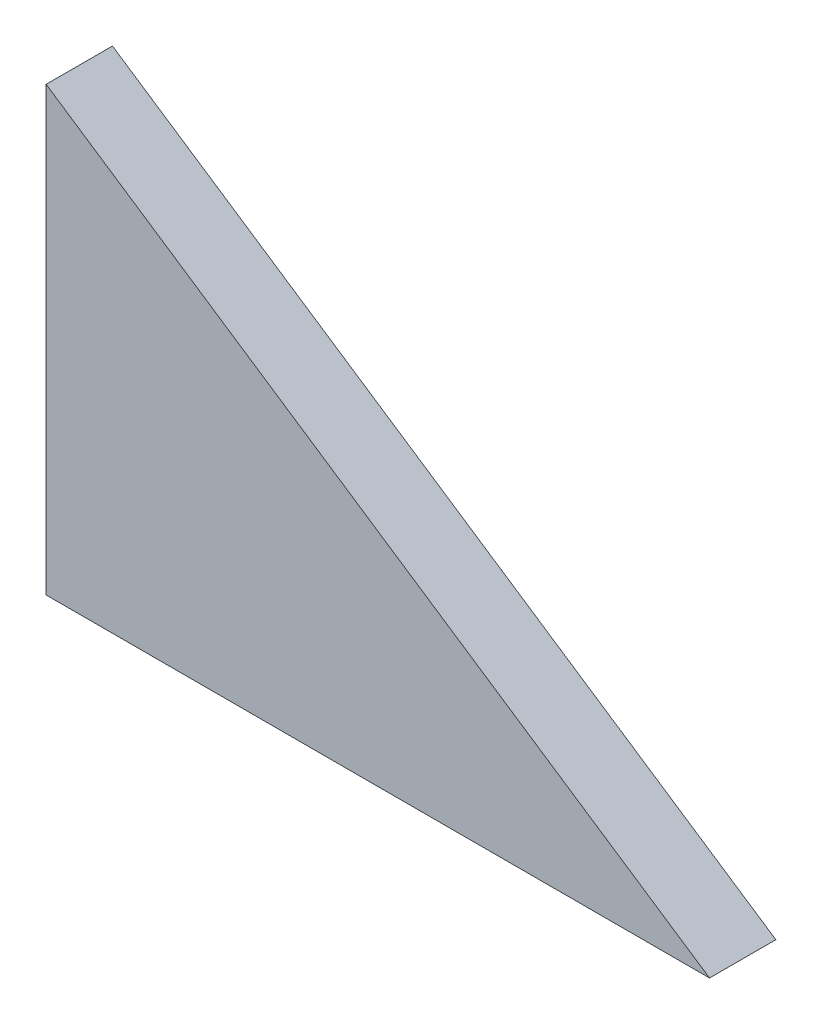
ISO-10303-21;
HEADER;
FILE_DESCRIPTION(('STEP AP214'),'2;1');
FILE_NAME('part.step','',(''),(''),'','','');
FILE_SCHEMA(('AUTOMOTIVE_DESIGN { 1 0 10303 214 1 1 1 1 }'));
ENDSEC;
DATA;
#1=APPLICATION_CONTEXT('core data for automotive mechanical design processes');
#2=APPLICATION_PROTOCOL_DEFINITION('international standard','automotive_design',2000,#1);
#3=PRODUCT_CONTEXT('',#1,'mechanical');
#4=PRODUCT('Part','Part','',(#3));
#5=PRODUCT_RELATED_PRODUCT_CATEGORY('part','',(#4));
#6=PRODUCT_DEFINITION_FORMATION('','',#4);
#7=PRODUCT_DEFINITION_CONTEXT('part definition',#1,'design');
#8=PRODUCT_DEFINITION('design','',#6,#7);
#9=PRODUCT_DEFINITION_SHAPE('','',#8);
#10=(LENGTH_UNIT() NAMED_UNIT(*) SI_UNIT(.MILLI.,.METRE.));
#11=(NAMED_UNIT(*) PLANE_ANGLE_UNIT() SI_UNIT($,.RADIAN.));
#12=(NAMED_UNIT(*) SI_UNIT($,.STERADIAN.) SOLID_ANGLE_UNIT());
#13=UNCERTAINTY_MEASURE_WITH_UNIT(LENGTH_MEASURE(1.E-05),#10,'distance_accuracy_value','');
#14=(GEOMETRIC_REPRESENTATION_CONTEXT(3) GLOBAL_UNCERTAINTY_ASSIGNED_CONTEXT((#13)) GLOBAL_UNIT_ASSIGNED_CONTEXT((#10,
#11,#12)) REPRESENTATION_CONTEXT('',''));
#15=CARTESIAN_POINT('',(0.,0.,0.));
#16=DIRECTION('',(0.,0.,1.));
#17=DIRECTION('',(1.,0.,0.));
#18=AXIS2_PLACEMENT_3D('',#15,#16,#17);
#19=CARTESIAN_POINT('',(0.,20.,3.));
#20=DIRECTION('',(-0.554700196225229,-0.832050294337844,0.));
#21=DIRECTION('',(0.832050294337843,-0.554700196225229,0.));
#22=AXIS2_PLACEMENT_3D('',#19,#20,#21);
#23=PLANE('',#22);
#24=DIRECTION('',(-0.832050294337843,0.554700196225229,0.));
#25=VECTOR('',#24,1.);
#26=CARTESIAN_POINT('',(0.,20.,0.));
#27=LINE('',#26,#25);
#28=CARTESIAN_POINT('',(30.,0.,0.));
#29=VERTEX_POINT('',#28);
#30=CARTESIAN_POINT('',(0.,20.,0.));
#31=VERTEX_POINT('',#30);
#32=EDGE_CURVE('E66',#29,#31,#27,.T.);
#33=ORIENTED_EDGE('',*,*,#32,.T.);
#34=DIRECTION('',(0.,0.,-1.));
#35=VECTOR('',#34,1.);
#36=CARTESIAN_POINT('',(0.,20.,3.));
#37=LINE('',#36,#35);
#38=CARTESIAN_POINT('',(0.,20.,3.));
#39=VERTEX_POINT('',#38);
#40=EDGE_CURVE('E11',#39,#31,#37,.T.);
#41=ORIENTED_EDGE('',*,*,#40,.F.);
#42=DIRECTION('',(-0.832050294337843,0.554700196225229,0.));
#43=VECTOR('',#42,1.);
#44=CARTESIAN_POINT('',(0.,20.,3.));
#45=LINE('',#44,#43);
#46=CARTESIAN_POINT('',(30.,0.,3.));
#47=VERTEX_POINT('',#46);
#48=EDGE_CURVE('E80',#47,#39,#45,.T.);
#49=ORIENTED_EDGE('',*,*,#48,.F.);
#50=DIRECTION('',(0.,0.,-1.));
#51=VECTOR('',#50,1.);
#52=CARTESIAN_POINT('',(30.,0.,3.));
#53=LINE('',#52,#51);
#54=EDGE_CURVE('E76',#47,#29,#53,.T.);
#55=ORIENTED_EDGE('',*,*,#54,.T.);
#56=EDGE_LOOP('',(#33,#41,#49,#55));
#57=FACE_BOUND('',#56,.T.);
#58=ADVANCED_FACE('F30',(#57),#23,.F.);
#59=CARTESIAN_POINT('',(0.,0.,3.));
#60=DIRECTION('',(1.,0.,0.));
#61=DIRECTION('',(0.,0.,-1.));
#62=AXIS2_PLACEMENT_3D('',#59,#60,#61);
#63=PLANE('',#62);
#64=DIRECTION('',(0.,-1.,0.));
#65=VECTOR('',#64,1.);
#66=CARTESIAN_POINT('',(0.,0.,0.));
#67=LINE('',#66,#65);
#68=CARTESIAN_POINT('',(0.,0.,0.));
#69=VERTEX_POINT('',#68);
#70=EDGE_CURVE('E63',#31,#69,#67,.T.);
#71=ORIENTED_EDGE('',*,*,#70,.T.);
#72=DIRECTION('',(0.,0.,-1.));
#73=VECTOR('',#72,1.);
#74=CARTESIAN_POINT('',(0.,0.,3.));
#75=LINE('',#74,#73);
#76=CARTESIAN_POINT('',(0.,0.,3.));
#77=VERTEX_POINT('',#76);
#78=EDGE_CURVE('E37',#77,#69,#75,.T.);
#79=ORIENTED_EDGE('',*,*,#78,.F.);
#80=DIRECTION('',(0.,-1.,0.));
#81=VECTOR('',#80,1.);
#82=CARTESIAN_POINT('',(0.,0.,3.));
#83=LINE('',#82,#81);
#84=EDGE_CURVE('E48',#39,#77,#83,.T.);
#85=ORIENTED_EDGE('',*,*,#84,.F.);
#86=ORIENTED_EDGE('',*,*,#40,.T.);
#87=EDGE_LOOP('',(#71,#79,#85,#86));
#88=FACE_BOUND('',#87,.T.);
#89=ADVANCED_FACE('F72',(#88),#63,.F.);
#90=CARTESIAN_POINT('',(30.,0.,3.));
#91=DIRECTION('',(0.,1.,0.));
#92=DIRECTION('',(-1.,0.,0.));
#93=AXIS2_PLACEMENT_3D('',#90,#91,#92);
#94=PLANE('',#93);
#95=DIRECTION('',(1.,0.,0.));
#96=VECTOR('',#95,1.);
#97=CARTESIAN_POINT('',(30.,0.,0.));
#98=LINE('',#97,#96);
#99=EDGE_CURVE('E67',#69,#29,#98,.T.);
#100=ORIENTED_EDGE('',*,*,#99,.T.);
#101=ORIENTED_EDGE('',*,*,#54,.F.);
#102=DIRECTION('',(1.,0.,0.));
#103=VECTOR('',#102,1.);
#104=CARTESIAN_POINT('',(30.,0.,3.));
#105=LINE('',#104,#103);
#106=EDGE_CURVE('E44',#77,#47,#105,.T.);
#107=ORIENTED_EDGE('',*,*,#106,.F.);
#108=ORIENTED_EDGE('',*,*,#78,.T.);
#109=EDGE_LOOP('',(#100,#101,#107,#108));
#110=FACE_BOUND('',#109,.T.);
#111=ADVANCED_FACE('F85',(#110),#94,.F.);
#112=CARTESIAN_POINT('',(0.,20.,3.));
#113=DIRECTION('',(0.,0.,1.));
#114=DIRECTION('',(1.,0.,0.));
#115=AXIS2_PLACEMENT_3D('',#112,#113,#114);
#116=PLANE('',#115);
#117=ORIENTED_EDGE('',*,*,#48,.T.);
#118=ORIENTED_EDGE('',*,*,#84,.T.);
#119=ORIENTED_EDGE('',*,*,#106,.T.);
#120=EDGE_LOOP('',(#117,#118,#119));
#121=FACE_BOUND('',#120,.T.);
#122=ADVANCED_FACE('F86',(#121),#116,.T.);
#123=CARTESIAN_POINT('',(0.,20.,0.));
#124=DIRECTION('',(0.,0.,1.));
#125=DIRECTION('',(1.,0.,0.));
#126=AXIS2_PLACEMENT_3D('',#123,#124,#125);
#127=PLANE('',#126);
#128=ORIENTED_EDGE('',*,*,#32,.F.);
#129=ORIENTED_EDGE('',*,*,#99,.F.);
#130=ORIENTED_EDGE('',*,*,#70,.F.);
#131=EDGE_LOOP('',(#128,#129,#130));
#132=FACE_BOUND('',#131,.T.);
#133=ADVANCED_FACE('F64',(#132),#127,.F.);
#134=CLOSED_SHELL('',(#58,#89,#111,#122,#133));
#135=MANIFOLD_SOLID_BREP('B2',#134);
#136=ADVANCED_BREP_SHAPE_REPRESENTATION('',(#18,#135),#14);
#137=SHAPE_DEFINITION_REPRESENTATION(#9,#136);
ENDSEC;
END-ISO-10303-21;
